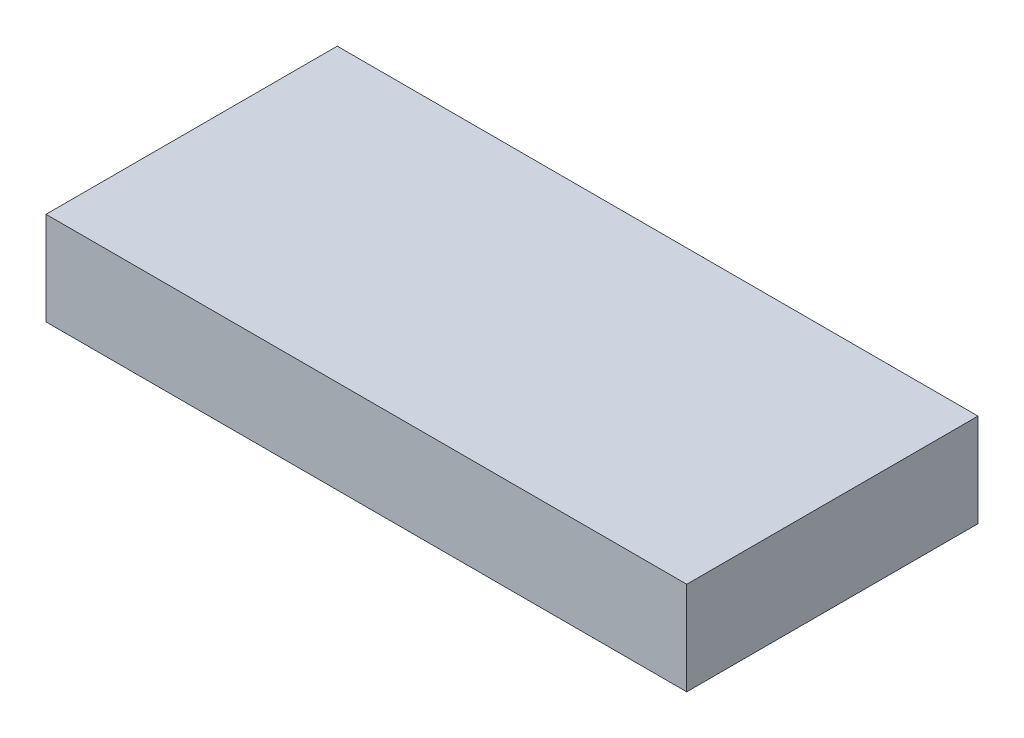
from build123d import *

# Parameters (mm, degrees)
SKETCH2_W           = 110
SKETCH2_H           = 50
BOSS_EXTRUDE2_DEPTH = 16


with BuildPart() as part:
    # Sketch2 → Boss-Extrude2 (new body)
    with BuildSketch(Plane(origin=(0, 0, 0), x_dir=(1, 0, 0), z_dir=(0, 1, 0))):
        with Locations((-55, 25)):
            Rectangle(SKETCH2_W, SKETCH2_H)
    extrude(amount=BOSS_EXTRUDE2_DEPTH)


solid = part.part
